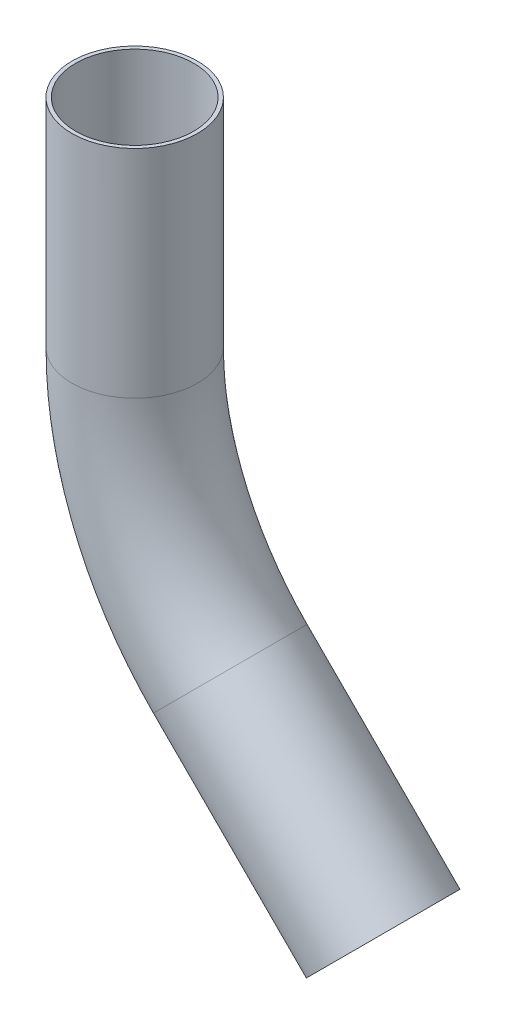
from build123d import *

# Parameters (mm, degrees)
SKIZZE1_R  = 25
WANDUNG1_T = -1.5


with BuildPart() as part:
    # Austragung1: sweep along a curve in space
    with BuildLine() as austragung1_path:
        Line((0, -86.152236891, 0), (0, 0, 0))
        ThreePointArc((0, -86.152236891, 0), (9.895660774, -135.901083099, 0), (38.076118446, -178.076118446, 0))
        Line((38.076118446, -178.076118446, 0), (98.994949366, -238.994949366, 0))
    # Skizze1 → Austragung1 (sweep)
    with BuildSketch(Plane(origin=(0, 0, 0), x_dir=(1, 0, 0), z_dir=(0, 1, 0))):
        Circle(SKIZZE1_R)
    sweep(path=austragung1_path.line)

    # Wandung1
    wandung1_openings = [part.faces().sort_by_distance(p)[0] for p in [
        (98.994949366, -238.994949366, 0),
        (0, 0, 0),
    ]]
    offset(amount=WANDUNG1_T, openings=wandung1_openings, kind=Kind.INTERSECTION)


solid = part.part
